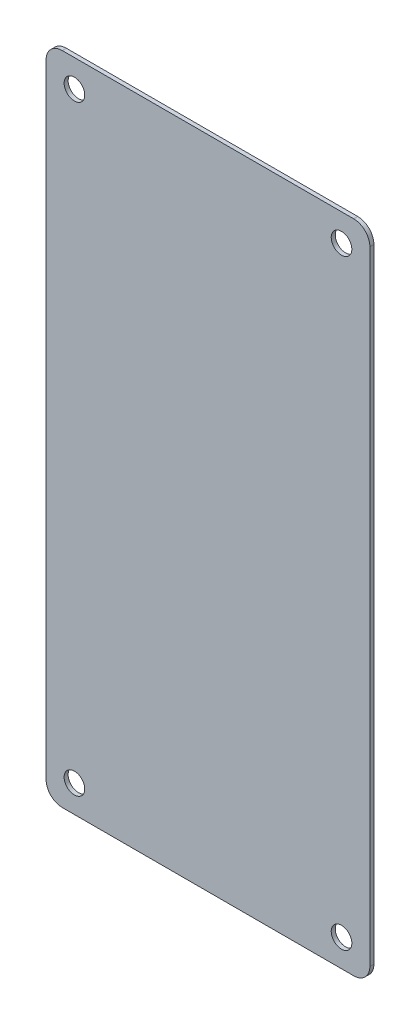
ISO-10303-21;
HEADER;
FILE_DESCRIPTION(('STEP AP214'),'2;1');
FILE_NAME('part.step','',(''),(''),'','','');
FILE_SCHEMA(('AUTOMOTIVE_DESIGN { 1 0 10303 214 1 1 1 1 }'));
ENDSEC;
DATA;
#1=APPLICATION_CONTEXT('core data for automotive mechanical design processes');
#2=APPLICATION_PROTOCOL_DEFINITION('international standard','automotive_design',2000,#1);
#3=PRODUCT_CONTEXT('',#1,'mechanical');
#4=PRODUCT('Part','Part','',(#3));
#5=PRODUCT_RELATED_PRODUCT_CATEGORY('part','',(#4));
#6=PRODUCT_DEFINITION_FORMATION('','',#4);
#7=PRODUCT_DEFINITION_CONTEXT('part definition',#1,'design');
#8=PRODUCT_DEFINITION('design','',#6,#7);
#9=PRODUCT_DEFINITION_SHAPE('','',#8);
#10=(LENGTH_UNIT() NAMED_UNIT(*) SI_UNIT(.MILLI.,.METRE.));
#11=(NAMED_UNIT(*) PLANE_ANGLE_UNIT() SI_UNIT($,.RADIAN.));
#12=(NAMED_UNIT(*) SI_UNIT($,.STERADIAN.) SOLID_ANGLE_UNIT());
#13=UNCERTAINTY_MEASURE_WITH_UNIT(LENGTH_MEASURE(1.E-05),#10,'distance_accuracy_value','');
#14=(GEOMETRIC_REPRESENTATION_CONTEXT(3) GLOBAL_UNCERTAINTY_ASSIGNED_CONTEXT((#13)) GLOBAL_UNIT_ASSIGNED_CONTEXT((#10,
#11,#12)) REPRESENTATION_CONTEXT('',''));
#15=CARTESIAN_POINT('',(0.,0.,0.));
#16=DIRECTION('',(0.,0.,1.));
#17=DIRECTION('',(1.,0.,0.));
#18=AXIS2_PLACEMENT_3D('',#15,#16,#17);
#19=CARTESIAN_POINT('',(40.,-81.,1.));
#20=DIRECTION('',(-1.,0.,0.));
#21=DIRECTION('',(0.,0.,1.));
#22=AXIS2_PLACEMENT_3D('',#19,#20,#21);
#23=PLANE('',#22);
#24=DIRECTION('',(0.,1.,0.));
#25=VECTOR('',#24,1.);
#26=CARTESIAN_POINT('',(40.,-81.,1.));
#27=LINE('',#26,#25);
#28=CARTESIAN_POINT('',(40.,-77.,1.));
#29=VERTEX_POINT('',#28);
#30=CARTESIAN_POINT('',(40.,77.,1.));
#31=VERTEX_POINT('',#30);
#32=EDGE_CURVE('E129',#29,#31,#27,.T.);
#33=ORIENTED_EDGE('',*,*,#32,.F.);
#34=DIRECTION('',(0.,0.,-1.));
#35=VECTOR('',#34,1.);
#36=CARTESIAN_POINT('',(40.,-77.,1.));
#37=LINE('',#36,#35);
#38=CARTESIAN_POINT('',(40.,-77.,0.));
#39=VERTEX_POINT('',#38);
#40=EDGE_CURVE('E11',#29,#39,#37,.T.);
#41=ORIENTED_EDGE('',*,*,#40,.T.);
#42=DIRECTION('',(0.,1.,0.));
#43=VECTOR('',#42,1.);
#44=CARTESIAN_POINT('',(40.,-81.,0.));
#45=LINE('',#44,#43);
#46=CARTESIAN_POINT('',(40.,77.,0.));
#47=VERTEX_POINT('',#46);
#48=EDGE_CURVE('E131',#39,#47,#45,.T.);
#49=ORIENTED_EDGE('',*,*,#48,.T.);
#50=DIRECTION('',(0.,0.,-1.));
#51=VECTOR('',#50,1.);
#52=CARTESIAN_POINT('',(40.,77.,1.));
#53=LINE('',#52,#51);
#54=EDGE_CURVE('E42',#47,#31,#53,.F.);
#55=ORIENTED_EDGE('',*,*,#54,.T.);
#56=EDGE_LOOP('',(#33,#41,#49,#55));
#57=FACE_BOUND('',#56,.T.);
#58=ADVANCED_FACE('F34',(#57),#23,.F.);
#59=CARTESIAN_POINT('',(-40.,81.,1.));
#60=DIRECTION('',(0.,-1.,0.));
#61=DIRECTION('',(0.,0.,-1.));
#62=AXIS2_PLACEMENT_3D('',#59,#60,#61);
#63=PLANE('',#62);
#64=DIRECTION('',(-1.,0.,0.));
#65=VECTOR('',#64,1.);
#66=CARTESIAN_POINT('',(-40.,81.,0.));
#67=LINE('',#66,#65);
#68=CARTESIAN_POINT('',(36.,81.,0.));
#69=VERTEX_POINT('',#68);
#70=CARTESIAN_POINT('',(-36.,81.,0.));
#71=VERTEX_POINT('',#70);
#72=EDGE_CURVE('E127',#69,#71,#67,.T.);
#73=ORIENTED_EDGE('',*,*,#72,.T.);
#74=DIRECTION('',(0.,0.,-1.));
#75=VECTOR('',#74,1.);
#76=CARTESIAN_POINT('',(-36.,81.,1.));
#77=LINE('',#76,#75);
#78=CARTESIAN_POINT('',(-36.,81.,1.));
#79=VERTEX_POINT('',#78);
#80=EDGE_CURVE('E106',#71,#79,#77,.F.);
#81=ORIENTED_EDGE('',*,*,#80,.T.);
#82=DIRECTION('',(-1.,0.,0.));
#83=VECTOR('',#82,1.);
#84=CARTESIAN_POINT('',(-40.,81.,1.));
#85=LINE('',#84,#83);
#86=CARTESIAN_POINT('',(36.,81.,1.));
#87=VERTEX_POINT('',#86);
#88=EDGE_CURVE('E167',#87,#79,#85,.T.);
#89=ORIENTED_EDGE('',*,*,#88,.F.);
#90=DIRECTION('',(0.,0.,-1.));
#91=VECTOR('',#90,1.);
#92=CARTESIAN_POINT('',(36.,81.,1.));
#93=LINE('',#92,#91);
#94=EDGE_CURVE('E111',#87,#69,#93,.T.);
#95=ORIENTED_EDGE('',*,*,#94,.T.);
#96=EDGE_LOOP('',(#73,#81,#89,#95));
#97=FACE_BOUND('',#96,.T.);
#98=ADVANCED_FACE('F171',(#97),#63,.F.);
#99=CARTESIAN_POINT('',(-40.,-81.,1.));
#100=DIRECTION('',(1.,0.,0.));
#101=DIRECTION('',(0.,0.,-1.));
#102=AXIS2_PLACEMENT_3D('',#99,#100,#101);
#103=PLANE('',#102);
#104=DIRECTION('',(0.,-1.,0.));
#105=VECTOR('',#104,1.);
#106=CARTESIAN_POINT('',(-40.,-81.,1.));
#107=LINE('',#106,#105);
#108=CARTESIAN_POINT('',(-40.,77.,1.));
#109=VERTEX_POINT('',#108);
#110=CARTESIAN_POINT('',(-40.,-77.,1.));
#111=VERTEX_POINT('',#110);
#112=EDGE_CURVE('E120',#109,#111,#107,.T.);
#113=ORIENTED_EDGE('',*,*,#112,.F.);
#114=DIRECTION('',(0.,0.,-1.));
#115=VECTOR('',#114,1.);
#116=CARTESIAN_POINT('',(-40.,77.,1.));
#117=LINE('',#116,#115);
#118=CARTESIAN_POINT('',(-40.,77.,0.));
#119=VERTEX_POINT('',#118);
#120=EDGE_CURVE('E105',#109,#119,#117,.T.);
#121=ORIENTED_EDGE('',*,*,#120,.T.);
#122=DIRECTION('',(0.,-1.,0.));
#123=VECTOR('',#122,1.);
#124=CARTESIAN_POINT('',(-40.,-81.,0.));
#125=LINE('',#124,#123);
#126=CARTESIAN_POINT('',(-40.,-77.,0.));
#127=VERTEX_POINT('',#126);
#128=EDGE_CURVE('E118',#119,#127,#125,.T.);
#129=ORIENTED_EDGE('',*,*,#128,.T.);
#130=DIRECTION('',(0.,0.,-1.));
#131=VECTOR('',#130,1.);
#132=CARTESIAN_POINT('',(-40.,-77.,1.));
#133=LINE('',#132,#131);
#134=EDGE_CURVE('E122',#127,#111,#133,.F.);
#135=ORIENTED_EDGE('',*,*,#134,.T.);
#136=EDGE_LOOP('',(#113,#121,#129,#135));
#137=FACE_BOUND('',#136,.T.);
#138=ADVANCED_FACE('F117',(#137),#103,.F.);
#139=CARTESIAN_POINT('',(-40.,-81.,1.));
#140=DIRECTION('',(0.,1.,0.));
#141=DIRECTION('',(0.,0.,1.));
#142=AXIS2_PLACEMENT_3D('',#139,#140,#141);
#143=PLANE('',#142);
#144=DIRECTION('',(1.,0.,0.));
#145=VECTOR('',#144,1.);
#146=CARTESIAN_POINT('',(-40.,-81.,1.));
#147=LINE('',#146,#145);
#148=CARTESIAN_POINT('',(-36.,-81.,1.));
#149=VERTEX_POINT('',#148);
#150=CARTESIAN_POINT('',(36.,-81.,1.));
#151=VERTEX_POINT('',#150);
#152=EDGE_CURVE('E135',#149,#151,#147,.T.);
#153=ORIENTED_EDGE('',*,*,#152,.F.);
#154=DIRECTION('',(0.,0.,-1.));
#155=VECTOR('',#154,1.);
#156=CARTESIAN_POINT('',(-36.,-81.,1.));
#157=LINE('',#156,#155);
#158=CARTESIAN_POINT('',(-36.,-81.,0.));
#159=VERTEX_POINT('',#158);
#160=EDGE_CURVE('E152',#149,#159,#157,.T.);
#161=ORIENTED_EDGE('',*,*,#160,.T.);
#162=DIRECTION('',(1.,0.,0.));
#163=VECTOR('',#162,1.);
#164=CARTESIAN_POINT('',(-40.,-81.,0.));
#165=LINE('',#164,#163);
#166=CARTESIAN_POINT('',(36.,-81.,0.));
#167=VERTEX_POINT('',#166);
#168=EDGE_CURVE('E126',#159,#167,#165,.T.);
#169=ORIENTED_EDGE('',*,*,#168,.T.);
#170=DIRECTION('',(0.,0.,-1.));
#171=VECTOR('',#170,1.);
#172=CARTESIAN_POINT('',(36.,-81.,1.));
#173=LINE('',#172,#171);
#174=EDGE_CURVE('E49',#167,#151,#173,.F.);
#175=ORIENTED_EDGE('',*,*,#174,.T.);
#176=EDGE_LOOP('',(#153,#161,#169,#175));
#177=FACE_BOUND('',#176,.T.);
#178=ADVANCED_FACE('F260',(#177),#143,.F.);
#179=CARTESIAN_POINT('',(0.,0.,1.));
#180=DIRECTION('',(0.,0.,-1.));
#181=DIRECTION('',(-1.,0.,0.));
#182=AXIS2_PLACEMENT_3D('',#179,#180,#181);
#183=PLANE('',#182);
#184=CARTESIAN_POINT('',(-33.,-74.25,1.));
#185=DIRECTION('',(0.,0.,-1.));
#186=DIRECTION('',(-1.,0.,0.));
#187=AXIS2_PLACEMENT_3D('',#184,#185,#186);
#188=CIRCLE('',#187,2.55);
#189=CARTESIAN_POINT('',(-35.55,-74.25,1.));
#190=VERTEX_POINT('',#189);
#191=EDGE_CURVE('E186',#190,#190,#188,.T.);
#192=ORIENTED_EDGE('',*,*,#191,.T.);
#193=EDGE_LOOP('',(#192));
#194=FACE_BOUND('',#193,.T.);
#195=CARTESIAN_POINT('',(-33.,74.25,1.));
#196=DIRECTION('',(0.,0.,-1.));
#197=DIRECTION('',(-1.,0.,0.));
#198=AXIS2_PLACEMENT_3D('',#195,#196,#197);
#199=CIRCLE('',#198,2.55);
#200=CARTESIAN_POINT('',(-35.55,74.25,1.));
#201=VERTEX_POINT('',#200);
#202=EDGE_CURVE('E192',#201,#201,#199,.T.);
#203=ORIENTED_EDGE('',*,*,#202,.T.);
#204=EDGE_LOOP('',(#203));
#205=FACE_BOUND('',#204,.T.);
#206=CARTESIAN_POINT('',(33.,74.25,1.));
#207=DIRECTION('',(0.,0.,-1.));
#208=DIRECTION('',(-1.,0.,0.));
#209=AXIS2_PLACEMENT_3D('',#206,#207,#208);
#210=CIRCLE('',#209,2.54999999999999);
#211=CARTESIAN_POINT('',(30.45,74.25,1.));
#212=VERTEX_POINT('',#211);
#213=EDGE_CURVE('E181',#212,#212,#210,.T.);
#214=ORIENTED_EDGE('',*,*,#213,.T.);
#215=EDGE_LOOP('',(#214));
#216=FACE_BOUND('',#215,.T.);
#217=CARTESIAN_POINT('',(33.,-74.25,1.));
#218=DIRECTION('',(0.,0.,-1.));
#219=DIRECTION('',(-1.,0.,0.));
#220=AXIS2_PLACEMENT_3D('',#217,#218,#219);
#221=CIRCLE('',#220,2.54999999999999);
#222=CARTESIAN_POINT('',(30.45,-74.25,1.));
#223=VERTEX_POINT('',#222);
#224=EDGE_CURVE('E172',#223,#223,#221,.T.);
#225=ORIENTED_EDGE('',*,*,#224,.T.);
#226=EDGE_LOOP('',(#225));
#227=FACE_BOUND('',#226,.T.);
#228=ORIENTED_EDGE('',*,*,#88,.T.);
#229=CARTESIAN_POINT('',(-36.,77.,1.));
#230=DIRECTION('',(0.,0.,-1.));
#231=DIRECTION('',(-1.,0.,0.));
#232=AXIS2_PLACEMENT_3D('',#229,#230,#231);
#233=CIRCLE('',#232,4.);
#234=EDGE_CURVE('E149',#79,#109,#233,.F.);
#235=ORIENTED_EDGE('',*,*,#234,.T.);
#236=ORIENTED_EDGE('',*,*,#112,.T.);
#237=CARTESIAN_POINT('',(-36.,-77.,1.));
#238=DIRECTION('',(0.,0.,-1.));
#239=DIRECTION('',(-1.,0.,0.));
#240=AXIS2_PLACEMENT_3D('',#237,#238,#239);
#241=CIRCLE('',#240,4.);
#242=EDGE_CURVE('E56',#111,#149,#241,.F.);
#243=ORIENTED_EDGE('',*,*,#242,.T.);
#244=ORIENTED_EDGE('',*,*,#152,.T.);
#245=CARTESIAN_POINT('',(36.,-77.,1.));
#246=DIRECTION('',(0.,0.,-1.));
#247=DIRECTION('',(-1.,0.,0.));
#248=AXIS2_PLACEMENT_3D('',#245,#246,#247);
#249=CIRCLE('',#248,4.);
#250=EDGE_CURVE('E146',#151,#29,#249,.F.);
#251=ORIENTED_EDGE('',*,*,#250,.T.);
#252=ORIENTED_EDGE('',*,*,#32,.T.);
#253=CARTESIAN_POINT('',(36.,77.,1.));
#254=DIRECTION('',(0.,0.,-1.));
#255=DIRECTION('',(-1.,0.,0.));
#256=AXIS2_PLACEMENT_3D('',#253,#254,#255);
#257=CIRCLE('',#256,4.);
#258=EDGE_CURVE('E144',#31,#87,#257,.F.);
#259=ORIENTED_EDGE('',*,*,#258,.T.);
#260=EDGE_LOOP('',(#228,#235,#236,#243,#244,#251,#252,#259));
#261=FACE_BOUND('',#260,.T.);
#262=ADVANCED_FACE('F164',(#194,#205,#216,#227,#261),#183,.F.);
#263=CARTESIAN_POINT('',(0.,0.,0.));
#264=DIRECTION('',(0.,0.,-1.));
#265=DIRECTION('',(-1.,0.,0.));
#266=AXIS2_PLACEMENT_3D('',#263,#264,#265);
#267=PLANE('',#266);
#268=CARTESIAN_POINT('',(-33.,-74.25,0.));
#269=DIRECTION('',(0.,0.,-1.));
#270=DIRECTION('',(-1.,0.,0.));
#271=AXIS2_PLACEMENT_3D('',#268,#269,#270);
#272=CIRCLE('',#271,2.55);
#273=CARTESIAN_POINT('',(-35.55,-74.25,0.));
#274=VERTEX_POINT('',#273);
#275=EDGE_CURVE('E183',#274,#274,#272,.T.);
#276=ORIENTED_EDGE('',*,*,#275,.F.);
#277=EDGE_LOOP('',(#276));
#278=FACE_BOUND('',#277,.T.);
#279=CARTESIAN_POINT('',(-33.,74.25,0.));
#280=DIRECTION('',(0.,0.,-1.));
#281=DIRECTION('',(-1.,0.,0.));
#282=AXIS2_PLACEMENT_3D('',#279,#280,#281);
#283=CIRCLE('',#282,2.55);
#284=CARTESIAN_POINT('',(-35.55,74.25,0.));
#285=VERTEX_POINT('',#284);
#286=EDGE_CURVE('E189',#285,#285,#283,.T.);
#287=ORIENTED_EDGE('',*,*,#286,.F.);
#288=EDGE_LOOP('',(#287));
#289=FACE_BOUND('',#288,.T.);
#290=CARTESIAN_POINT('',(33.,74.25,0.));
#291=DIRECTION('',(0.,0.,-1.));
#292=DIRECTION('',(-1.,0.,0.));
#293=AXIS2_PLACEMENT_3D('',#290,#291,#292);
#294=CIRCLE('',#293,2.54999999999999);
#295=CARTESIAN_POINT('',(30.45,74.25,0.));
#296=VERTEX_POINT('',#295);
#297=EDGE_CURVE('E195',#296,#296,#294,.T.);
#298=ORIENTED_EDGE('',*,*,#297,.F.);
#299=EDGE_LOOP('',(#298));
#300=FACE_BOUND('',#299,.T.);
#301=CARTESIAN_POINT('',(33.,-74.25,0.));
#302=DIRECTION('',(0.,0.,-1.));
#303=DIRECTION('',(-1.,0.,0.));
#304=AXIS2_PLACEMENT_3D('',#301,#302,#303);
#305=CIRCLE('',#304,2.54999999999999);
#306=CARTESIAN_POINT('',(30.45,-74.25,0.));
#307=VERTEX_POINT('',#306);
#308=EDGE_CURVE('E174',#307,#307,#305,.T.);
#309=ORIENTED_EDGE('',*,*,#308,.F.);
#310=EDGE_LOOP('',(#309));
#311=FACE_BOUND('',#310,.T.);
#312=ORIENTED_EDGE('',*,*,#128,.F.);
#313=CARTESIAN_POINT('',(-36.,77.,0.));
#314=DIRECTION('',(0.,0.,-1.));
#315=DIRECTION('',(-1.,0.,0.));
#316=AXIS2_PLACEMENT_3D('',#313,#314,#315);
#317=CIRCLE('',#316,4.);
#318=EDGE_CURVE('E101',#119,#71,#317,.T.);
#319=ORIENTED_EDGE('',*,*,#318,.T.);
#320=ORIENTED_EDGE('',*,*,#72,.F.);
#321=CARTESIAN_POINT('',(36.,77.,0.));
#322=DIRECTION('',(0.,0.,-1.));
#323=DIRECTION('',(-1.,0.,0.));
#324=AXIS2_PLACEMENT_3D('',#321,#322,#323);
#325=CIRCLE('',#324,4.);
#326=EDGE_CURVE('E121',#69,#47,#325,.T.);
#327=ORIENTED_EDGE('',*,*,#326,.T.);
#328=ORIENTED_EDGE('',*,*,#48,.F.);
#329=CARTESIAN_POINT('',(36.,-77.,0.));
#330=DIRECTION('',(0.,0.,-1.));
#331=DIRECTION('',(-1.,0.,0.));
#332=AXIS2_PLACEMENT_3D('',#329,#330,#331);
#333=CIRCLE('',#332,4.);
#334=EDGE_CURVE('E138',#39,#167,#333,.T.);
#335=ORIENTED_EDGE('',*,*,#334,.T.);
#336=ORIENTED_EDGE('',*,*,#168,.F.);
#337=CARTESIAN_POINT('',(-36.,-77.,0.));
#338=DIRECTION('',(0.,0.,-1.));
#339=DIRECTION('',(-1.,0.,0.));
#340=AXIS2_PLACEMENT_3D('',#337,#338,#339);
#341=CIRCLE('',#340,4.);
#342=EDGE_CURVE('E112',#159,#127,#341,.T.);
#343=ORIENTED_EDGE('',*,*,#342,.T.);
#344=EDGE_LOOP('',(#312,#319,#320,#327,#328,#335,#336,#343));
#345=FACE_BOUND('',#344,.T.);
#346=ADVANCED_FACE('F124',(#278,#289,#300,#311,#345),#267,.T.);
#347=CARTESIAN_POINT('',(-36.,77.,1.));
#348=DIRECTION('',(0.,0.,-1.));
#349=DIRECTION('',(-1.,0.,0.));
#350=AXIS2_PLACEMENT_3D('',#347,#348,#349);
#351=CYLINDRICAL_SURFACE('',#350,4.);
#352=ORIENTED_EDGE('',*,*,#234,.F.);
#353=ORIENTED_EDGE('',*,*,#80,.F.);
#354=ORIENTED_EDGE('',*,*,#318,.F.);
#355=ORIENTED_EDGE('',*,*,#120,.F.);
#356=EDGE_LOOP('',(#352,#353,#354,#355));
#357=FACE_BOUND('',#356,.T.);
#358=ADVANCED_FACE('F104',(#357),#351,.T.);
#359=CARTESIAN_POINT('',(-36.,-77.,1.));
#360=DIRECTION('',(0.,0.,-1.));
#361=DIRECTION('',(-1.,0.,0.));
#362=AXIS2_PLACEMENT_3D('',#359,#360,#361);
#363=CYLINDRICAL_SURFACE('',#362,4.);
#364=ORIENTED_EDGE('',*,*,#242,.F.);
#365=ORIENTED_EDGE('',*,*,#134,.F.);
#366=ORIENTED_EDGE('',*,*,#342,.F.);
#367=ORIENTED_EDGE('',*,*,#160,.F.);
#368=EDGE_LOOP('',(#364,#365,#366,#367));
#369=FACE_BOUND('',#368,.T.);
#370=ADVANCED_FACE('F237',(#369),#363,.T.);
#371=CARTESIAN_POINT('',(36.,-77.,1.));
#372=DIRECTION('',(0.,0.,-1.));
#373=DIRECTION('',(-1.,0.,0.));
#374=AXIS2_PLACEMENT_3D('',#371,#372,#373);
#375=CYLINDRICAL_SURFACE('',#374,4.);
#376=ORIENTED_EDGE('',*,*,#250,.F.);
#377=ORIENTED_EDGE('',*,*,#174,.F.);
#378=ORIENTED_EDGE('',*,*,#334,.F.);
#379=ORIENTED_EDGE('',*,*,#40,.F.);
#380=EDGE_LOOP('',(#376,#377,#378,#379));
#381=FACE_BOUND('',#380,.T.);
#382=ADVANCED_FACE('F223',(#381),#375,.T.);
#383=CARTESIAN_POINT('',(36.,77.,1.));
#384=DIRECTION('',(0.,0.,-1.));
#385=DIRECTION('',(-1.,0.,0.));
#386=AXIS2_PLACEMENT_3D('',#383,#384,#385);
#387=CYLINDRICAL_SURFACE('',#386,4.);
#388=ORIENTED_EDGE('',*,*,#258,.F.);
#389=ORIENTED_EDGE('',*,*,#54,.F.);
#390=ORIENTED_EDGE('',*,*,#326,.F.);
#391=ORIENTED_EDGE('',*,*,#94,.F.);
#392=EDGE_LOOP('',(#388,#389,#390,#391));
#393=FACE_BOUND('',#392,.T.);
#394=ADVANCED_FACE('F36',(#393),#387,.T.);
#395=CARTESIAN_POINT('',(33.,-74.25,1.));
#396=DIRECTION('',(0.,0.,-1.));
#397=DIRECTION('',(-1.,0.,0.));
#398=AXIS2_PLACEMENT_3D('',#395,#396,#397);
#399=CYLINDRICAL_SURFACE('',#398,2.54999999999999);
#400=ORIENTED_EDGE('',*,*,#224,.F.);
#401=EDGE_LOOP('',(#400));
#402=FACE_BOUND('',#401,.T.);
#403=ORIENTED_EDGE('',*,*,#308,.T.);
#404=EDGE_LOOP('',(#403));
#405=FACE_BOUND('',#404,.T.);
#406=ADVANCED_FACE('F207',(#402,#405),#399,.F.);
#407=CARTESIAN_POINT('',(33.,74.25,1.));
#408=DIRECTION('',(0.,0.,-1.));
#409=DIRECTION('',(-1.,0.,0.));
#410=AXIS2_PLACEMENT_3D('',#407,#408,#409);
#411=CYLINDRICAL_SURFACE('',#410,2.54999999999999);
#412=ORIENTED_EDGE('',*,*,#213,.F.);
#413=EDGE_LOOP('',(#412));
#414=FACE_BOUND('',#413,.T.);
#415=ORIENTED_EDGE('',*,*,#297,.T.);
#416=EDGE_LOOP('',(#415));
#417=FACE_BOUND('',#416,.T.);
#418=ADVANCED_FACE('F203',(#414,#417),#411,.F.);
#419=CARTESIAN_POINT('',(-33.,74.25,1.));
#420=DIRECTION('',(0.,0.,-1.));
#421=DIRECTION('',(-1.,0.,0.));
#422=AXIS2_PLACEMENT_3D('',#419,#420,#421);
#423=CYLINDRICAL_SURFACE('',#422,2.55);
#424=ORIENTED_EDGE('',*,*,#202,.F.);
#425=EDGE_LOOP('',(#424));
#426=FACE_BOUND('',#425,.T.);
#427=ORIENTED_EDGE('',*,*,#286,.T.);
#428=EDGE_LOOP('',(#427));
#429=FACE_BOUND('',#428,.T.);
#430=ADVANCED_FACE('F206',(#426,#429),#423,.F.);
#431=CARTESIAN_POINT('',(-33.,-74.25,1.));
#432=DIRECTION('',(0.,0.,-1.));
#433=DIRECTION('',(-1.,0.,0.));
#434=AXIS2_PLACEMENT_3D('',#431,#432,#433);
#435=CYLINDRICAL_SURFACE('',#434,2.55);
#436=ORIENTED_EDGE('',*,*,#191,.F.);
#437=EDGE_LOOP('',(#436));
#438=FACE_BOUND('',#437,.T.);
#439=ORIENTED_EDGE('',*,*,#275,.T.);
#440=EDGE_LOOP('',(#439));
#441=FACE_BOUND('',#440,.T.);
#442=ADVANCED_FACE('F287',(#438,#441),#435,.F.);
#443=CLOSED_SHELL('',(#58,#98,#138,#178,#262,#346,#358,#370,#382,#394,#406,#418,#430,#442));
#444=MANIFOLD_SOLID_BREP('B2',#443);
#445=ADVANCED_BREP_SHAPE_REPRESENTATION('',(#18,#444),#14);
#446=SHAPE_DEFINITION_REPRESENTATION(#9,#445);
ENDSEC;
END-ISO-10303-21;
